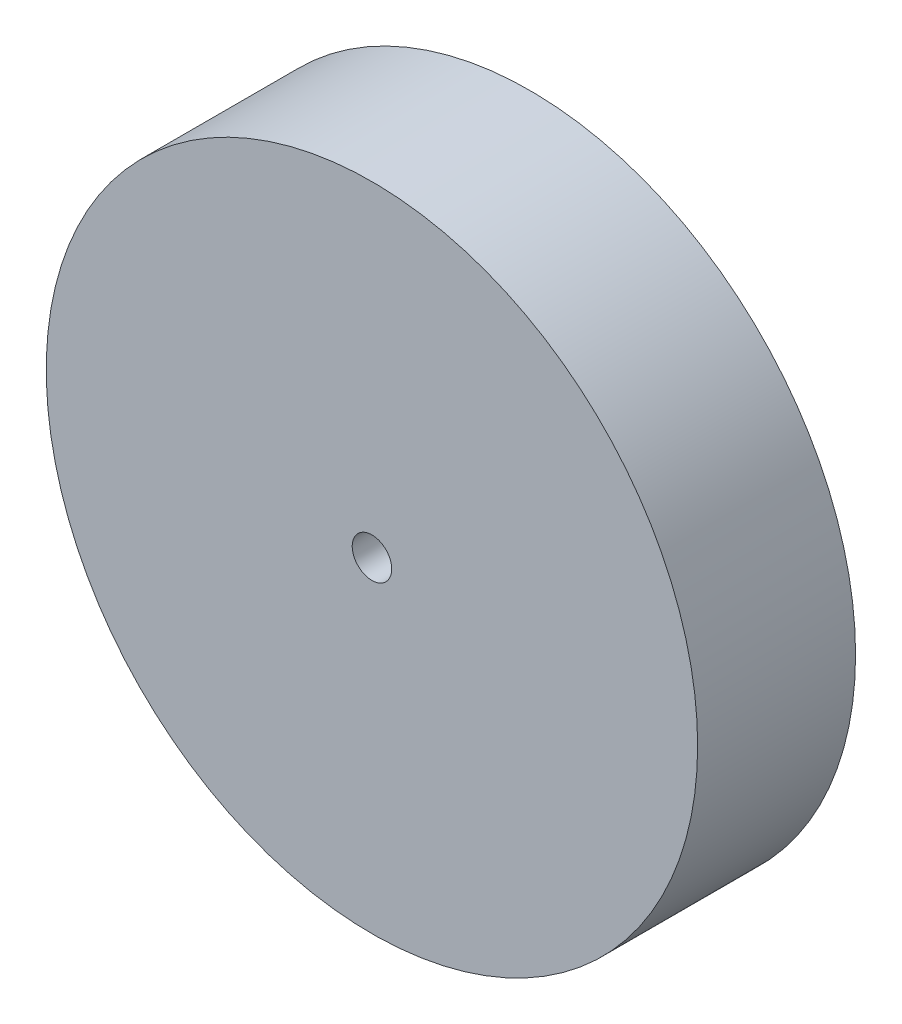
ISO-10303-21;
HEADER;
FILE_DESCRIPTION(('STEP AP214'),'2;1');
FILE_NAME('part.step','',(''),(''),'','','');
FILE_SCHEMA(('AUTOMOTIVE_DESIGN { 1 0 10303 214 1 1 1 1 }'));
ENDSEC;
DATA;
#1=APPLICATION_CONTEXT('core data for automotive mechanical design processes');
#2=APPLICATION_PROTOCOL_DEFINITION('international standard','automotive_design',2000,#1);
#3=PRODUCT_CONTEXT('',#1,'mechanical');
#4=PRODUCT('Part','Part','',(#3));
#5=PRODUCT_RELATED_PRODUCT_CATEGORY('part','',(#4));
#6=PRODUCT_DEFINITION_FORMATION('','',#4);
#7=PRODUCT_DEFINITION_CONTEXT('part definition',#1,'design');
#8=PRODUCT_DEFINITION('design','',#6,#7);
#9=PRODUCT_DEFINITION_SHAPE('','',#8);
#10=(LENGTH_UNIT() NAMED_UNIT(*) SI_UNIT(.MILLI.,.METRE.));
#11=(NAMED_UNIT(*) PLANE_ANGLE_UNIT() SI_UNIT($,.RADIAN.));
#12=(NAMED_UNIT(*) SI_UNIT($,.STERADIAN.) SOLID_ANGLE_UNIT());
#13=UNCERTAINTY_MEASURE_WITH_UNIT(LENGTH_MEASURE(1.E-05),#10,'distance_accuracy_value','');
#14=(GEOMETRIC_REPRESENTATION_CONTEXT(3) GLOBAL_UNCERTAINTY_ASSIGNED_CONTEXT((#13)) GLOBAL_UNIT_ASSIGNED_CONTEXT((#10,
#11,#12)) REPRESENTATION_CONTEXT('',''));
#15=CARTESIAN_POINT('',(0.,0.,0.));
#16=DIRECTION('',(0.,0.,1.));
#17=DIRECTION('',(1.,0.,0.));
#18=AXIS2_PLACEMENT_3D('',#15,#16,#17);
#19=CARTESIAN_POINT('',(0.,0.,4.));
#20=DIRECTION('',(0.,0.,1.));
#21=DIRECTION('',(1.,0.,0.));
#22=AXIS2_PLACEMENT_3D('',#19,#20,#21);
#23=PLANE('',#22);
#24=CARTESIAN_POINT('',(0.,0.,4.));
#25=DIRECTION('',(0.,0.,1.));
#26=DIRECTION('',(1.,0.,0.));
#27=AXIS2_PLACEMENT_3D('',#24,#25,#26);
#28=CIRCLE('',#27,8.25);
#29=CARTESIAN_POINT('',(8.25,0.,4.));
#30=VERTEX_POINT('',#29);
#31=EDGE_CURVE('E10',#30,#30,#28,.T.);
#32=ORIENTED_EDGE('',*,*,#31,.T.);
#33=EDGE_LOOP('',(#32));
#34=FACE_BOUND('',#33,.T.);
#35=CARTESIAN_POINT('',(0.,0.,4.));
#36=DIRECTION('',(0.,0.,1.));
#37=DIRECTION('',(1.,0.,0.));
#38=AXIS2_PLACEMENT_3D('',#35,#36,#37);
#39=CIRCLE('',#38,0.5);
#40=CARTESIAN_POINT('',(0.5,0.,4.));
#41=VERTEX_POINT('',#40);
#42=EDGE_CURVE('E42',#41,#41,#39,.T.);
#43=ORIENTED_EDGE('',*,*,#42,.F.);
#44=EDGE_LOOP('',(#43));
#45=FACE_BOUND('',#44,.T.);
#46=ADVANCED_FACE('F31',(#34,#45),#23,.T.);
#47=CARTESIAN_POINT('',(0.,0.,0.));
#48=DIRECTION('',(0.,0.,1.));
#49=DIRECTION('',(1.,0.,0.));
#50=AXIS2_PLACEMENT_3D('',#47,#48,#49);
#51=PLANE('',#50);
#52=CARTESIAN_POINT('',(0.,0.,0.));
#53=DIRECTION('',(0.,0.,1.));
#54=DIRECTION('',(1.,0.,0.));
#55=AXIS2_PLACEMENT_3D('',#52,#53,#54);
#56=CIRCLE('',#55,8.25);
#57=CARTESIAN_POINT('',(8.25,0.,0.));
#58=VERTEX_POINT('',#57);
#59=EDGE_CURVE('E35',#58,#58,#56,.T.);
#60=ORIENTED_EDGE('',*,*,#59,.F.);
#61=EDGE_LOOP('',(#60));
#62=FACE_BOUND('',#61,.T.);
#63=CARTESIAN_POINT('',(0.,0.,0.));
#64=DIRECTION('',(0.,0.,1.));
#65=DIRECTION('',(1.,0.,0.));
#66=AXIS2_PLACEMENT_3D('',#63,#64,#65);
#67=CIRCLE('',#66,0.5);
#68=CARTESIAN_POINT('',(0.5,0.,0.));
#69=VERTEX_POINT('',#68);
#70=EDGE_CURVE('E44',#69,#69,#67,.T.);
#71=ORIENTED_EDGE('',*,*,#70,.T.);
#72=EDGE_LOOP('',(#71));
#73=FACE_BOUND('',#72,.T.);
#74=ADVANCED_FACE('F54',(#62,#73),#51,.F.);
#75=CARTESIAN_POINT('',(0.,0.,4.));
#76=DIRECTION('',(0.,0.,-1.));
#77=DIRECTION('',(-1.,0.,0.));
#78=AXIS2_PLACEMENT_3D('',#75,#76,#77);
#79=CYLINDRICAL_SURFACE('',#78,8.25);
#80=ORIENTED_EDGE('',*,*,#31,.F.);
#81=EDGE_LOOP('',(#80));
#82=FACE_BOUND('',#81,.T.);
#83=ORIENTED_EDGE('',*,*,#59,.T.);
#84=EDGE_LOOP('',(#83));
#85=FACE_BOUND('',#84,.T.);
#86=ADVANCED_FACE('F33',(#82,#85),#79,.T.);
#87=CARTESIAN_POINT('',(0.,0.,4.));
#88=DIRECTION('',(0.,0.,-1.));
#89=DIRECTION('',(-1.,0.,0.));
#90=AXIS2_PLACEMENT_3D('',#87,#88,#89);
#91=CYLINDRICAL_SURFACE('',#90,0.5);
#92=ORIENTED_EDGE('',*,*,#42,.T.);
#93=EDGE_LOOP('',(#92));
#94=FACE_BOUND('',#93,.T.);
#95=ORIENTED_EDGE('',*,*,#70,.F.);
#96=EDGE_LOOP('',(#95));
#97=FACE_BOUND('',#96,.T.);
#98=ADVANCED_FACE('F50',(#94,#97),#91,.F.);
#99=CLOSED_SHELL('',(#46,#74,#86,#98));
#100=MANIFOLD_SOLID_BREP('B2',#99);
#101=ADVANCED_BREP_SHAPE_REPRESENTATION('',(#18,#100),#14);
#102=SHAPE_DEFINITION_REPRESENTATION(#9,#101);
ENDSEC;
END-ISO-10303-21;
